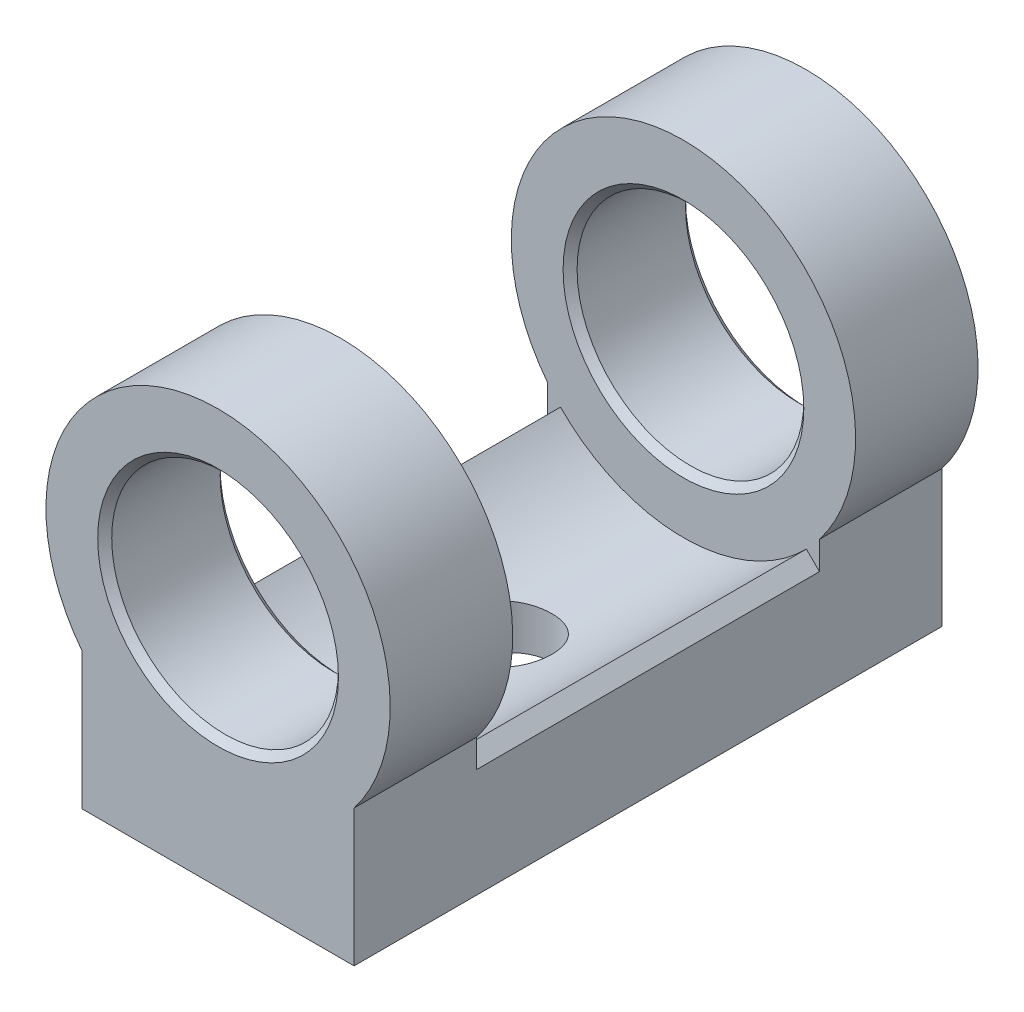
ISO-10303-21;
HEADER;
FILE_DESCRIPTION(('STEP AP214'),'2;1');
FILE_NAME('part.step','',(''),(''),'','','');
FILE_SCHEMA(('AUTOMOTIVE_DESIGN { 1 0 10303 214 1 1 1 1 }'));
ENDSEC;
DATA;
#1=APPLICATION_CONTEXT('core data for automotive mechanical design processes');
#2=APPLICATION_PROTOCOL_DEFINITION('international standard','automotive_design',2000,#1);
#3=PRODUCT_CONTEXT('',#1,'mechanical');
#4=PRODUCT('Part','Part','',(#3));
#5=PRODUCT_RELATED_PRODUCT_CATEGORY('part','',(#4));
#6=PRODUCT_DEFINITION_FORMATION('','',#4);
#7=PRODUCT_DEFINITION_CONTEXT('part definition',#1,'design');
#8=PRODUCT_DEFINITION('design','',#6,#7);
#9=PRODUCT_DEFINITION_SHAPE('','',#8);
#10=(LENGTH_UNIT() NAMED_UNIT(*) SI_UNIT(.MILLI.,.METRE.));
#11=(NAMED_UNIT(*) PLANE_ANGLE_UNIT() SI_UNIT($,.RADIAN.));
#12=(NAMED_UNIT(*) SI_UNIT($,.STERADIAN.) SOLID_ANGLE_UNIT());
#13=UNCERTAINTY_MEASURE_WITH_UNIT(LENGTH_MEASURE(1.E-05),#10,'distance_accuracy_value','');
#14=(GEOMETRIC_REPRESENTATION_CONTEXT(3) GLOBAL_UNCERTAINTY_ASSIGNED_CONTEXT((#13)) GLOBAL_UNIT_ASSIGNED_CONTEXT((#10,
#11,#12)) REPRESENTATION_CONTEXT('',''));
#15=CARTESIAN_POINT('',(0.,0.,0.));
#16=DIRECTION('',(0.,0.,1.));
#17=DIRECTION('',(1.,0.,0.));
#18=AXIS2_PLACEMENT_3D('',#15,#16,#17);
#19=CARTESIAN_POINT('',(0.,6.15,0.));
#20=DIRECTION('',(0.,-1.,0.));
#21=DIRECTION('',(0.,0.,-1.));
#22=AXIS2_PLACEMENT_3D('',#19,#20,#21);
#23=CYLINDRICAL_SURFACE('',#22,1.425);
#24=CARTESIAN_POINT('',(0.,-6.15,-1.425));
#25=CARTESIAN_POINT('',(-0.0789134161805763,-6.14999857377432,-1.42499748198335));
#26=CARTESIAN_POINT('',(-0.157856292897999,-6.1484658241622,-1.41842281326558));
#27=CARTESIAN_POINT('',(-0.313491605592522,-6.14249960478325,-1.39232996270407));
#28=CARTESIAN_POINT('',(-0.390182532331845,-6.13806423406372,-1.37280329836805));
#29=CARTESIAN_POINT('',(-0.539042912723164,-6.12678554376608,-1.32145728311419));
#30=CARTESIAN_POINT('',(-0.611217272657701,-6.11994489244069,-1.28965154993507));
#31=CARTESIAN_POINT('',(-0.749204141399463,-6.10459000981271,-1.21469538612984));
#32=CARTESIAN_POINT('',(-0.815016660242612,-6.09607578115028,-1.17154497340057));
#33=CARTESIAN_POINT('',(-0.939589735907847,-6.07813292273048,-1.07430853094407));
#34=CARTESIAN_POINT('',(-0.998220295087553,-6.06869181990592,-1.02005824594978));
#35=CARTESIAN_POINT('',(-1.10563685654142,-6.05004512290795,-0.902514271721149));
#36=CARTESIAN_POINT('',(-1.15442189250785,-6.04083955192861,-0.839219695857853));
#37=CARTESIAN_POINT('',(-1.24135120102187,-6.02358218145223,-0.70440339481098));
#38=CARTESIAN_POINT('',(-1.27935427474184,-6.0155463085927,-0.632788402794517));
#39=CARTESIAN_POINT('',(-1.34273426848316,-6.00171842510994,-0.483971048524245));
#40=CARTESIAN_POINT('',(-1.36811289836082,-5.9959261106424,-0.406769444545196));
#41=CARTESIAN_POINT('',(-1.40508840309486,-5.98736870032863,-0.250388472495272));
#42=CARTESIAN_POINT('',(-1.41691690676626,-5.98455279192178,-0.171266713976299));
#43=CARTESIAN_POINT('',(-1.42717713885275,-5.98211462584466,-0.0121155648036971));
#44=CARTESIAN_POINT('',(-1.42561072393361,-5.98249192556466,0.0679136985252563));
#45=CARTESIAN_POINT('',(-1.40931134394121,-5.98635167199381,0.224865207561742));
#46=CARTESIAN_POINT('',(-1.39485017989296,-5.98977001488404,0.301817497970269));
#47=CARTESIAN_POINT('',(-1.35360360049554,-5.9992250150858,0.452173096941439));
#48=CARTESIAN_POINT('',(-1.32681741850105,-6.00526183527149,0.525576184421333));
#49=CARTESIAN_POINT('',(-1.2614388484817,-6.0193350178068,0.667499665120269));
#50=CARTESIAN_POINT('',(-1.2227443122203,-6.0273885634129,0.735971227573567));
#51=CARTESIAN_POINT('',(-1.13471908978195,-6.04457756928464,0.865548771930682));
#52=CARTESIAN_POINT('',(-1.08538678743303,-6.05371319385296,0.926653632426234));
#53=CARTESIAN_POINT('',(-0.976059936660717,-6.07231001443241,1.04132527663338));
#54=CARTESIAN_POINT('',(-0.915834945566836,-6.08177372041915,1.09467219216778));
#55=CARTESIAN_POINT('',(-0.787183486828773,-6.09975854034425,1.19054732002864));
#56=CARTESIAN_POINT('',(-0.718756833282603,-6.10827963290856,1.23307528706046));
#57=CARTESIAN_POINT('',(-0.575358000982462,-6.1234523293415,1.306170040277));
#58=CARTESIAN_POINT('',(-0.50036917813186,-6.13009898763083,1.33670526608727));
#59=CARTESIAN_POINT('',(-0.346135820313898,-6.14073754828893,1.38467844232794));
#60=CARTESIAN_POINT('',(-0.266891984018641,-6.14472988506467,1.4021185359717));
#61=CARTESIAN_POINT('',(-0.108281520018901,-6.14954715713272,1.42308022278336));
#62=CARTESIAN_POINT('',(-0.0289565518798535,-6.15044034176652,1.42690177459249));
#63=CARTESIAN_POINT('',(0.129198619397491,-6.14915117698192,1.42133479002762));
#64=CARTESIAN_POINT('',(0.208028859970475,-6.1469690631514,1.41194726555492));
#65=CARTESIAN_POINT('',(0.361943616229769,-6.13981783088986,1.38047682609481));
#66=CARTESIAN_POINT('',(0.437062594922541,-6.13488382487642,1.35855376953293));
#67=CARTESIAN_POINT('',(0.582555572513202,-6.12278229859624,1.30281407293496));
#68=CARTESIAN_POINT('',(0.652929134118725,-6.11561457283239,1.26899633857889));
#69=CARTESIAN_POINT('',(0.788155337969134,-6.09967407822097,1.18981984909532));
#70=CARTESIAN_POINT('',(0.852903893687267,-6.09087786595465,1.14428815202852));
#71=CARTESIAN_POINT('',(0.973948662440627,-6.07269931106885,1.04320121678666));
#72=CARTESIAN_POINT('',(1.03024363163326,-6.06331688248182,0.987644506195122));
#73=CARTESIAN_POINT('',(1.13398953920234,-6.04478355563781,0.866701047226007));
#74=CARTESIAN_POINT('',(1.18123159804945,-6.03564156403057,0.801133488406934));
#75=CARTESIAN_POINT('',(1.26403703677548,-6.01884562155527,0.662820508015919));
#76=CARTESIAN_POINT('',(1.29960093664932,-6.01119160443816,0.590075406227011));
#77=CARTESIAN_POINT('',(1.35778766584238,-5.99831653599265,0.43986928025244));
#78=CARTESIAN_POINT('',(1.38048585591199,-5.99308135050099,0.36243872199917));
#79=CARTESIAN_POINT('',(1.41251016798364,-5.9856152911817,0.204723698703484));
#80=CARTESIAN_POINT('',(1.42183873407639,-5.98338386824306,0.124439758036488));
#81=CARTESIAN_POINT('',(1.42674526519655,-5.98221554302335,-0.0345896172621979));
#82=CARTESIAN_POINT('',(1.42265540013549,-5.98319905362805,-0.113324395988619));
#83=CARTESIAN_POINT('',(1.40159080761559,-5.98816817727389,-0.268949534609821));
#84=CARTESIAN_POINT('',(1.38461627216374,-5.99215374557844,-0.345839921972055));
#85=CARTESIAN_POINT('',(1.33843332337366,-6.00263683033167,-0.495290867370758));
#86=CARTESIAN_POINT('',(1.30927885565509,-6.00912326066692,-0.567868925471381));
#87=CARTESIAN_POINT('',(1.23960804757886,-6.02388033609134,-0.707150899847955));
#88=CARTESIAN_POINT('',(1.19909036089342,-6.03215119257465,-0.773854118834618));
#89=CARTESIAN_POINT('',(1.10676576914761,-6.04977863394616,-0.9011176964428));
#90=CARTESIAN_POINT('',(1.054724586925,-6.05915551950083,-0.961505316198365));
#91=CARTESIAN_POINT('',(0.941297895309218,-6.07780844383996,-1.07279904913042));
#92=CARTESIAN_POINT('',(0.879910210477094,-6.08708445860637,-1.12370294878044));
#93=CARTESIAN_POINT('',(0.748425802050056,-6.10465547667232,-1.21531890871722));
#94=CARTESIAN_POINT('',(0.678212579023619,-6.11293373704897,-1.25586719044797));
#95=CARTESIAN_POINT('',(0.531786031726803,-6.12740544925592,-1.32452103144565));
#96=CARTESIAN_POINT('',(0.455577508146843,-6.13360054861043,-1.35263642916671));
#97=CARTESIAN_POINT('',(0.316143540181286,-6.14217730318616,-1.39094610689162));
#98=CARTESIAN_POINT('',(0.253639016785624,-6.14509186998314,-1.40369069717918));
#99=CARTESIAN_POINT('',(0.127429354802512,-6.14900374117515,-1.42071842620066));
#100=CARTESIAN_POINT('',(0.0637242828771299,-6.15000115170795,-1.42500203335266));
#101=CARTESIAN_POINT('',(0.,-6.15,-1.425));
#102=B_SPLINE_CURVE_WITH_KNOTS('',3,(#24,#25,#26,#27,#28,#29,#30,#31,#32,#33,#34,#35,#36,#37,
#38,#39,#40,#41,#42,#43,#44,#45,#46,#47,#48,#49,#50,#51,#52,#53,#54,#55,#56,#57,#58,#59,#60,#61,
#62,#63,#64,#65,#66,#67,#68,#69,#70,#71,#72,#73,#74,#75,#76,#77,#78,#79,#80,#81,#82,#83,#84,#85,
#86,#87,#88,#89,#90,#91,#92,#93,#94,#95,#96,#97,#98,#99,#100,#101),.UNSPECIFIED.,.T.,.F.,(4,2,2,
2,2,2,2,2,2,2,2,2,2,2,2,2,2,2,2,2,2,2,2,2,2,2,2,2,2,2,2,2,2,2,2,2,2,2,4),(0.,0.236506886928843,
0.473168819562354,0.709569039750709,0.945968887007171,1.18615934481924,1.42637336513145,
1.66960153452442,1.91279675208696,2.15176961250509,2.39070934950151,2.6247286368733,
2.85876248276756,3.09486259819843,3.33099860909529,3.5728864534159,3.81477978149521,
4.05730548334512,4.2997914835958,4.5369023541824,4.7739950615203,5.00812962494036,
5.2422857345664,5.48011996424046,5.71798915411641,5.9608181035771,6.20363623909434,
6.44501696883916,6.68635356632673,6.92176144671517,7.15716581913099,7.39153844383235,
7.62593884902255,7.86563263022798,8.10538228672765,8.34871688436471,8.59185857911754,
8.78285355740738,8.97383796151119),.UNSPECIFIED.);
#103=CARTESIAN_POINT('',(0.,-6.15,-1.425));
#104=VERTEX_POINT('',#103);
#105=EDGE_CURVE('E135',#104,#104,#102,.T.);
#106=ORIENTED_EDGE('',*,*,#105,.T.);
#107=EDGE_LOOP('',(#106));
#108=FACE_BOUND('',#107,.T.);
#109=CARTESIAN_POINT('',(0.,-7.65685424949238,0.));
#110=DIRECTION('',(0.,-1.,0.));
#111=DIRECTION('',(0.,0.,-1.));
#112=AXIS2_PLACEMENT_3D('',#109,#110,#111);
#113=CIRCLE('',#112,1.425);
#114=CARTESIAN_POINT('',(0.,-7.65685424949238,-1.425));
#115=VERTEX_POINT('',#114);
#116=EDGE_CURVE('E161',#115,#115,#113,.F.);
#117=ORIENTED_EDGE('',*,*,#116,.F.);
#118=EDGE_LOOP('',(#117));
#119=FACE_BOUND('',#118,.T.);
#120=ADVANCED_FACE('F41',(#108,#119),#23,.F.);
#121=CARTESIAN_POINT('',(0.,0.,10.5));
#122=DIRECTION('',(0.,0.,-1.));
#123=DIRECTION('',(-1.,0.,0.));
#124=AXIS2_PLACEMENT_3D('',#121,#122,#123);
#125=CYLINDRICAL_SURFACE('',#124,6.15);
#126=CARTESIAN_POINT('',(0.,0.,-6.125));
#127=DIRECTION('',(0.,0.,1.));
#128=DIRECTION('',(1.,0.,0.));
#129=AXIS2_PLACEMENT_3D('',#126,#127,#128);
#130=CIRCLE('',#129,6.15);
#131=CARTESIAN_POINT('',(4.85772580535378,-3.77160443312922,-6.125));
#132=VERTEX_POINT('',#131);
#133=CARTESIAN_POINT('',(-4.85772580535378,-3.77160443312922,-6.125));
#134=VERTEX_POINT('',#133);
#135=EDGE_CURVE('E130',#132,#134,#130,.T.);
#136=ORIENTED_EDGE('',*,*,#135,.F.);
#137=DIRECTION('',(0.,0.,-1.));
#138=VECTOR('',#137,1.);
#139=CARTESIAN_POINT('',(4.85772580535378,-3.77160443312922,10.5));
#140=LINE('',#139,#138);
#141=CARTESIAN_POINT('',(4.85772580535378,-3.77160443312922,-10.5));
#142=VERTEX_POINT('',#141);
#143=EDGE_CURVE('E220',#132,#142,#140,.T.);
#144=ORIENTED_EDGE('',*,*,#143,.T.);
#145=CARTESIAN_POINT('',(0.,0.,-10.5));
#146=DIRECTION('',(0.,0.,1.));
#147=DIRECTION('',(1.,0.,0.));
#148=AXIS2_PLACEMENT_3D('',#145,#146,#147);
#149=CIRCLE('',#148,6.15);
#150=CARTESIAN_POINT('',(-4.85772580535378,-3.77160443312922,-10.5));
#151=VERTEX_POINT('',#150);
#152=EDGE_CURVE('E140',#142,#151,#149,.T.);
#153=ORIENTED_EDGE('',*,*,#152,.T.);
#154=DIRECTION('',(0.,0.,-1.));
#155=VECTOR('',#154,1.);
#156=CARTESIAN_POINT('',(-4.85772580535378,-3.77160443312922,10.5));
#157=LINE('',#156,#155);
#158=EDGE_CURVE('E122',#134,#151,#157,.T.);
#159=ORIENTED_EDGE('',*,*,#158,.F.);
#160=EDGE_LOOP('',(#136,#144,#153,#159));
#161=FACE_BOUND('',#160,.T.);
#162=ADVANCED_FACE('F138',(#161),#125,.T.);
#163=CARTESIAN_POINT('',(0.,0.,10.5));
#164=DIRECTION('',(0.,0.,-1.));
#165=DIRECTION('',(-1.,0.,0.));
#166=AXIS2_PLACEMENT_3D('',#163,#164,#165);
#167=CYLINDRICAL_SURFACE('',#166,4.05);
#168=CARTESIAN_POINT('',(0.,0.,-10.25));
#169=DIRECTION('',(0.,0.,1.));
#170=DIRECTION('',(1.,0.,0.));
#171=AXIS2_PLACEMENT_3D('',#168,#169,#170);
#172=CIRCLE('',#171,4.05);
#173=CARTESIAN_POINT('',(-4.05,0.,-10.25));
#174=VERTEX_POINT('',#173);
#175=EDGE_CURVE('E296',#174,#174,#172,.F.);
#176=CARTESIAN_POINT('',(0.,0.,-6.37500000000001));
#177=DIRECTION('',(0.,0.,1.));
#178=DIRECTION('',(1.,0.,0.));
#179=AXIS2_PLACEMENT_3D('',#176,#177,#178);
#180=CIRCLE('',#179,4.05);
#181=CARTESIAN_POINT('',(-4.05,0.,-6.37500000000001));
#182=VERTEX_POINT('',#181);
#183=EDGE_CURVE('E300',#182,#182,#180,.T.);
#184=CARTESIAN_POINT('',(-4.05,0.,-10.25));
#185=CARTESIAN_POINT('',(-4.05,0.,-10.2096354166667));
#186=CARTESIAN_POINT('',(-4.05,0.,-10.1692708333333));
#187=CARTESIAN_POINT('',(-4.05,0.,-10.0885416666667));
#188=CARTESIAN_POINT('',(-4.05,0.,-10.0481770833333));
#189=CARTESIAN_POINT('',(-4.05,0.,-9.96744791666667));
#190=CARTESIAN_POINT('',(-4.05,0.,-9.92708333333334));
#191=CARTESIAN_POINT('',(-4.05,0.,-9.84635416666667));
#192=CARTESIAN_POINT('',(-4.05,0.,-9.80598958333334));
#193=CARTESIAN_POINT('',(-4.05,0.,-9.72526041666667));
#194=CARTESIAN_POINT('',(-4.05,0.,-9.68489583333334));
#195=CARTESIAN_POINT('',(-4.05,0.,-9.60416666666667));
#196=CARTESIAN_POINT('',(-4.05,0.,-9.56380208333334));
#197=CARTESIAN_POINT('',(-4.05,0.,-9.48307291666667));
#198=CARTESIAN_POINT('',(-4.05,0.,-9.44270833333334));
#199=CARTESIAN_POINT('',(-4.05,0.,-9.36197916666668));
#200=CARTESIAN_POINT('',(-4.05,0.,-9.32161458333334));
#201=CARTESIAN_POINT('',(-4.05,0.,-9.24088541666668));
#202=CARTESIAN_POINT('',(-4.05,0.,-9.20052083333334));
#203=CARTESIAN_POINT('',(-4.05,0.,-9.11979166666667));
#204=CARTESIAN_POINT('',(-4.05,0.,-9.07942708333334));
#205=CARTESIAN_POINT('',(-4.05,0.,-8.99869791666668));
#206=CARTESIAN_POINT('',(-4.05,0.,-8.95833333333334));
#207=CARTESIAN_POINT('',(-4.05,0.,-8.87760416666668));
#208=CARTESIAN_POINT('',(-4.05,0.,-8.83723958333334));
#209=CARTESIAN_POINT('',(-4.05,0.,-8.75651041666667));
#210=CARTESIAN_POINT('',(-4.05,0.,-8.71614583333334));
#211=CARTESIAN_POINT('',(-4.05,0.,-8.63541666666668));
#212=CARTESIAN_POINT('',(-4.05,0.,-8.59505208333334));
#213=CARTESIAN_POINT('',(-4.05,0.,-8.51432291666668));
#214=CARTESIAN_POINT('',(-4.05,0.,-8.47395833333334));
#215=CARTESIAN_POINT('',(-4.05,0.,-8.39322916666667));
#216=CARTESIAN_POINT('',(-4.05,0.,-8.35286458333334));
#217=CARTESIAN_POINT('',(-4.05,0.,-8.27213541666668));
#218=CARTESIAN_POINT('',(-4.05,0.,-8.23177083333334));
#219=CARTESIAN_POINT('',(-4.05,0.,-8.15104166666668));
#220=CARTESIAN_POINT('',(-4.05,0.,-8.11067708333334));
#221=CARTESIAN_POINT('',(-4.05,0.,-8.02994791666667));
#222=CARTESIAN_POINT('',(-4.05,0.,-7.98958333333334));
#223=CARTESIAN_POINT('',(-4.05,0.,-7.90885416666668));
#224=CARTESIAN_POINT('',(-4.05,0.,-7.86848958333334));
#225=CARTESIAN_POINT('',(-4.05,0.,-7.78776041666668));
#226=CARTESIAN_POINT('',(-4.05,0.,-7.74739583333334));
#227=CARTESIAN_POINT('',(-4.05,0.,-7.66666666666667));
#228=CARTESIAN_POINT('',(-4.05,0.,-7.62630208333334));
#229=CARTESIAN_POINT('',(-4.05,0.,-7.54557291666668));
#230=CARTESIAN_POINT('',(-4.05,0.,-7.50520833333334));
#231=CARTESIAN_POINT('',(-4.05,0.,-7.42447916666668));
#232=CARTESIAN_POINT('',(-4.05,0.,-7.38411458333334));
#233=CARTESIAN_POINT('',(-4.05,0.,-7.30338541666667));
#234=CARTESIAN_POINT('',(-4.05,0.,-7.26302083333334));
#235=CARTESIAN_POINT('',(-4.05,0.,-7.18229166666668));
#236=CARTESIAN_POINT('',(-4.05,0.,-7.14192708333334));
#237=CARTESIAN_POINT('',(-4.05,0.,-7.06119791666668));
#238=CARTESIAN_POINT('',(-4.05,0.,-7.02083333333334));
#239=CARTESIAN_POINT('',(-4.05,0.,-6.94010416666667));
#240=CARTESIAN_POINT('',(-4.05,0.,-6.89973958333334));
#241=CARTESIAN_POINT('',(-4.05,0.,-6.81901041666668));
#242=CARTESIAN_POINT('',(-4.05,0.,-6.77864583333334));
#243=CARTESIAN_POINT('',(-4.05,0.,-6.69791666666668));
#244=CARTESIAN_POINT('',(-4.05,0.,-6.65755208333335));
#245=CARTESIAN_POINT('',(-4.05,0.,-6.57682291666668));
#246=CARTESIAN_POINT('',(-4.05,0.,-6.53645833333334));
#247=CARTESIAN_POINT('',(-4.05,0.,-6.45572916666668));
#248=CARTESIAN_POINT('',(-4.05,0.,-6.41536458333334));
#249=CARTESIAN_POINT('',(-4.05,0.,-6.37500000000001));
#250=B_SPLINE_CURVE_WITH_KNOTS('',3,(#184,#185,#186,#187,#188,#189,#190,#191,#192,#193,#194,
#195,#196,#197,#198,#199,#200,#201,#202,#203,#204,#205,#206,#207,#208,#209,#210,#211,#212,#213,
#214,#215,#216,#217,#218,#219,#220,#221,#222,#223,#224,#225,#226,#227,#228,#229,#230,#231,#232,
#233,#234,#235,#236,#237,#238,#239,#240,#241,#242,#243,#244,#245,#246,#247,#248,#249),
.UNSPECIFIED.,.F.,.F.,(4,2,2,2,2,2,2,2,2,2,2,2,2,2,2,2,2,2,2,2,2,2,2,2,2,2,2,2,2,2,2,2,4),(0.,
0.121093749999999,0.242187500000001,0.36328125,0.484374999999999,0.605468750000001,0.7265625,
0.847656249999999,0.968749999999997,1.08984375,1.2109375,1.33203125,1.453125,1.57421875,
1.6953125,1.81640625,1.9375,2.05859375,2.1796875,2.30078125,2.421875,2.54296875,2.6640625,
2.78515625,2.90625,3.02734375,3.1484375,3.26953125,3.390625,3.51171875,3.6328125,3.75390625,
3.875),.UNSPECIFIED.);
#251=EDGE_CURVE('BSEAM437',#174,#182,#250,.T.);
#252=ORIENTED_EDGE('',*,*,#175,.T.);
#253=ORIENTED_EDGE('',*,*,#183,.T.);
#254=ORIENTED_EDGE('',*,*,#251,.T.);
#255=ORIENTED_EDGE('',*,*,#251,.F.);
#256=EDGE_LOOP('',(#252,#254,#253,#255));
#257=FACE_BOUND('',#256,.T.);
#258=ADVANCED_FACE('F437',(#257),#167,.F.);
#259=CARTESIAN_POINT('',(4.85772580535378,-3.77160443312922,10.5));
#260=VERTEX_POINT('',#259);
#261=CARTESIAN_POINT('',(4.85772580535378,-3.77160443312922,6.125));
#262=VERTEX_POINT('',#261);
#263=EDGE_CURVE('E230',#260,#262,#140,.T.);
#264=ORIENTED_EDGE('',*,*,#263,.T.);
#265=CARTESIAN_POINT('',(0.,0.,6.125));
#266=DIRECTION('',(0.,0.,1.));
#267=DIRECTION('',(1.,0.,0.));
#268=AXIS2_PLACEMENT_3D('',#265,#266,#267);
#269=CIRCLE('',#268,6.15);
#270=CARTESIAN_POINT('',(-4.85772580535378,-3.77160443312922,6.125));
#271=VERTEX_POINT('',#270);
#272=EDGE_CURVE('E198',#262,#271,#269,.T.);
#273=ORIENTED_EDGE('',*,*,#272,.T.);
#274=CARTESIAN_POINT('',(-4.85772580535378,-3.77160443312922,10.5));
#275=VERTEX_POINT('',#274);
#276=EDGE_CURVE('E142',#275,#271,#157,.T.);
#277=ORIENTED_EDGE('',*,*,#276,.F.);
#278=CARTESIAN_POINT('',(0.,0.,10.5));
#279=DIRECTION('',(0.,0.,1.));
#280=DIRECTION('',(1.,0.,0.));
#281=AXIS2_PLACEMENT_3D('',#278,#279,#280);
#282=CIRCLE('',#281,6.15);
#283=EDGE_CURVE('E207',#260,#275,#282,.T.);
#284=ORIENTED_EDGE('',*,*,#283,.F.);
#285=EDGE_LOOP('',(#264,#273,#277,#284));
#286=FACE_BOUND('',#285,.T.);
#287=ADVANCED_FACE('F252',(#286),#125,.T.);
#288=CARTESIAN_POINT('',(-4.85772580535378,0.,10.5));
#289=DIRECTION('',(1.,0.,0.));
#290=DIRECTION('',(0.,1.,0.));
#291=AXIS2_PLACEMENT_3D('',#288,#289,#290);
#292=PLANE('',#291);
#293=ORIENTED_EDGE('',*,*,#276,.T.);
#294=DIRECTION('',(0.,-1.,0.));
#295=VECTOR('',#294,1.);
#296=CARTESIAN_POINT('',(-4.85772580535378,0.,6.125));
#297=LINE('',#296,#295);
#298=CARTESIAN_POINT('',(-4.85772580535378,-4.77160443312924,6.125));
#299=VERTEX_POINT('',#298);
#300=EDGE_CURVE('E57',#271,#299,#297,.T.);
#301=ORIENTED_EDGE('',*,*,#300,.T.);
#302=DIRECTION('',(0.,0.,-1.));
#303=VECTOR('',#302,1.);
#304=CARTESIAN_POINT('',(-4.85772580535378,-4.77160443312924,-6.125));
#305=LINE('',#304,#303);
#306=CARTESIAN_POINT('',(-4.85772580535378,-4.77160443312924,-6.125));
#307=VERTEX_POINT('',#306);
#308=EDGE_CURVE('E125',#299,#307,#305,.T.);
#309=ORIENTED_EDGE('',*,*,#308,.T.);
#310=DIRECTION('',(0.,1.,0.));
#311=VECTOR('',#310,1.);
#312=CARTESIAN_POINT('',(-4.85772580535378,0.,-6.125));
#313=LINE('',#312,#311);
#314=EDGE_CURVE('E119',#307,#134,#313,.T.);
#315=ORIENTED_EDGE('',*,*,#314,.T.);
#316=ORIENTED_EDGE('',*,*,#158,.T.);
#317=DIRECTION('',(0.,-1.,0.));
#318=VECTOR('',#317,1.);
#319=CARTESIAN_POINT('',(-4.85772580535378,0.,-10.5));
#320=LINE('',#319,#318);
#321=CARTESIAN_POINT('',(-4.85772580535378,-8.65685424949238,-10.5));
#322=VERTEX_POINT('',#321);
#323=EDGE_CURVE('E202',#151,#322,#320,.T.);
#324=ORIENTED_EDGE('',*,*,#323,.T.);
#325=DIRECTION('',(0.,0.,-1.));
#326=VECTOR('',#325,1.);
#327=CARTESIAN_POINT('',(-4.85772580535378,-8.65685424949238,10.5));
#328=LINE('',#327,#326);
#329=CARTESIAN_POINT('',(-4.85772580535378,-8.65685424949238,10.5));
#330=VERTEX_POINT('',#329);
#331=EDGE_CURVE('E143',#330,#322,#328,.T.);
#332=ORIENTED_EDGE('',*,*,#331,.F.);
#333=DIRECTION('',(0.,-1.,0.));
#334=VECTOR('',#333,1.);
#335=CARTESIAN_POINT('',(-4.85772580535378,0.,10.5));
#336=LINE('',#335,#334);
#337=EDGE_CURVE('E211',#275,#330,#336,.T.);
#338=ORIENTED_EDGE('',*,*,#337,.F.);
#339=EDGE_LOOP('',(#293,#301,#309,#315,#316,#324,#332,#338));
#340=FACE_BOUND('',#339,.T.);
#341=ADVANCED_FACE('F120',(#340),#292,.F.);
#342=CARTESIAN_POINT('',(0.,-8.65685424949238,10.5));
#343=DIRECTION('',(0.,1.,0.));
#344=DIRECTION('',(0.,0.,1.));
#345=AXIS2_PLACEMENT_3D('',#342,#343,#344);
#346=PLANE('',#345);
#347=CARTESIAN_POINT('',(0.,-8.65685424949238,0.));
#348=DIRECTION('',(0.,1.,0.));
#349=DIRECTION('',(0.,0.,1.));
#350=AXIS2_PLACEMENT_3D('',#347,#348,#349);
#351=CIRCLE('',#350,3.29000000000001);
#352=CARTESIAN_POINT('',(0.,-8.65685424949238,3.29000000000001));
#353=VERTEX_POINT('',#352);
#354=EDGE_CURVE('E282',#353,#353,#351,.T.);
#355=ORIENTED_EDGE('',*,*,#354,.T.);
#356=EDGE_LOOP('',(#355));
#357=FACE_BOUND('',#356,.T.);
#358=DIRECTION('',(1.,0.,0.));
#359=VECTOR('',#358,1.);
#360=CARTESIAN_POINT('',(0.,-8.65685424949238,-10.5));
#361=LINE('',#360,#359);
#362=CARTESIAN_POINT('',(4.85772580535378,-8.65685424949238,-10.5));
#363=VERTEX_POINT('',#362);
#364=EDGE_CURVE('E224',#322,#363,#361,.T.);
#365=ORIENTED_EDGE('',*,*,#364,.T.);
#366=DIRECTION('',(0.,0.,-1.));
#367=VECTOR('',#366,1.);
#368=CARTESIAN_POINT('',(4.85772580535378,-8.65685424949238,10.5));
#369=LINE('',#368,#367);
#370=CARTESIAN_POINT('',(4.85772580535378,-8.65685424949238,10.5));
#371=VERTEX_POINT('',#370);
#372=EDGE_CURVE('E149',#371,#363,#369,.T.);
#373=ORIENTED_EDGE('',*,*,#372,.F.);
#374=DIRECTION('',(1.,0.,0.));
#375=VECTOR('',#374,1.);
#376=CARTESIAN_POINT('',(0.,-8.65685424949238,10.5));
#377=LINE('',#376,#375);
#378=EDGE_CURVE('E215',#330,#371,#377,.T.);
#379=ORIENTED_EDGE('',*,*,#378,.F.);
#380=ORIENTED_EDGE('',*,*,#331,.T.);
#381=EDGE_LOOP('',(#365,#373,#379,#380));
#382=FACE_BOUND('',#381,.T.);
#383=ADVANCED_FACE('F246',(#357,#382),#346,.F.);
#384=CARTESIAN_POINT('',(0.,0.,10.25));
#385=DIRECTION('',(0.,0.,1.));
#386=DIRECTION('',(1.,0.,0.));
#387=AXIS2_PLACEMENT_3D('',#384,#385,#386);
#388=CIRCLE('',#387,4.05);
#389=CARTESIAN_POINT('',(-4.05,0.,10.25));
#390=VERTEX_POINT('',#389);
#391=EDGE_CURVE('E312',#390,#390,#388,.T.);
#392=CARTESIAN_POINT('',(0.,0.,6.37499999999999));
#393=DIRECTION('',(0.,0.,1.));
#394=DIRECTION('',(1.,0.,0.));
#395=AXIS2_PLACEMENT_3D('',#392,#393,#394);
#396=CIRCLE('',#395,4.05);
#397=CARTESIAN_POINT('',(-4.05,0.,6.37499999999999));
#398=VERTEX_POINT('',#397);
#399=EDGE_CURVE('E147',#398,#398,#396,.F.);
#400=CARTESIAN_POINT('',(-4.05,0.,10.25));
#401=CARTESIAN_POINT('',(-4.05,0.,10.2096354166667));
#402=CARTESIAN_POINT('',(-4.05,0.,10.1692708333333));
#403=CARTESIAN_POINT('',(-4.05,0.,10.0885416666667));
#404=CARTESIAN_POINT('',(-4.05,0.,10.0481770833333));
#405=CARTESIAN_POINT('',(-4.05,0.,9.96744791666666));
#406=CARTESIAN_POINT('',(-4.05,0.,9.92708333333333));
#407=CARTESIAN_POINT('',(-4.05,0.,9.84635416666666));
#408=CARTESIAN_POINT('',(-4.05,0.,9.80598958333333));
#409=CARTESIAN_POINT('',(-4.05,0.,9.72526041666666));
#410=CARTESIAN_POINT('',(-4.05,0.,9.68489583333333));
#411=CARTESIAN_POINT('',(-4.05,0.,9.60416666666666));
#412=CARTESIAN_POINT('',(-4.05,0.,9.56380208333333));
#413=CARTESIAN_POINT('',(-4.05,0.,9.48307291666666));
#414=CARTESIAN_POINT('',(-4.05,0.,9.44270833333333));
#415=CARTESIAN_POINT('',(-4.05,0.,9.36197916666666));
#416=CARTESIAN_POINT('',(-4.05,0.,9.32161458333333));
#417=CARTESIAN_POINT('',(-4.05,0.,9.24088541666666));
#418=CARTESIAN_POINT('',(-4.05,0.,9.20052083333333));
#419=CARTESIAN_POINT('',(-4.05,0.,9.11979166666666));
#420=CARTESIAN_POINT('',(-4.05,0.,9.07942708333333));
#421=CARTESIAN_POINT('',(-4.05,0.,8.99869791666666));
#422=CARTESIAN_POINT('',(-4.05,0.,8.95833333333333));
#423=CARTESIAN_POINT('',(-4.05,0.,8.87760416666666));
#424=CARTESIAN_POINT('',(-4.05,0.,8.83723958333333));
#425=CARTESIAN_POINT('',(-4.05,0.,8.75651041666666));
#426=CARTESIAN_POINT('',(-4.05,0.,8.71614583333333));
#427=CARTESIAN_POINT('',(-4.05,0.,8.63541666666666));
#428=CARTESIAN_POINT('',(-4.05,0.,8.59505208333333));
#429=CARTESIAN_POINT('',(-4.05,0.,8.51432291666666));
#430=CARTESIAN_POINT('',(-4.05,0.,8.47395833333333));
#431=CARTESIAN_POINT('',(-4.05,0.,8.39322916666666));
#432=CARTESIAN_POINT('',(-4.05,0.,8.35286458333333));
#433=CARTESIAN_POINT('',(-4.05,0.,8.27213541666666));
#434=CARTESIAN_POINT('',(-4.05,0.,8.23177083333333));
#435=CARTESIAN_POINT('',(-4.05,0.,8.15104166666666));
#436=CARTESIAN_POINT('',(-4.05,0.,8.11067708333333));
#437=CARTESIAN_POINT('',(-4.05,0.,8.02994791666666));
#438=CARTESIAN_POINT('',(-4.05,0.,7.98958333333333));
#439=CARTESIAN_POINT('',(-4.05,0.,7.90885416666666));
#440=CARTESIAN_POINT('',(-4.05,0.,7.86848958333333));
#441=CARTESIAN_POINT('',(-4.05,0.,7.78776041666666));
#442=CARTESIAN_POINT('',(-4.05,0.,7.74739583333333));
#443=CARTESIAN_POINT('',(-4.05,0.,7.66666666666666));
#444=CARTESIAN_POINT('',(-4.05,0.,7.62630208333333));
#445=CARTESIAN_POINT('',(-4.05,0.,7.54557291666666));
#446=CARTESIAN_POINT('',(-4.05,0.,7.50520833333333));
#447=CARTESIAN_POINT('',(-4.05,0.,7.42447916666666));
#448=CARTESIAN_POINT('',(-4.05,0.,7.38411458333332));
#449=CARTESIAN_POINT('',(-4.05,0.,7.30338541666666));
#450=CARTESIAN_POINT('',(-4.05,0.,7.26302083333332));
#451=CARTESIAN_POINT('',(-4.05,0.,7.18229166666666));
#452=CARTESIAN_POINT('',(-4.05,0.,7.14192708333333));
#453=CARTESIAN_POINT('',(-4.05,0.,7.06119791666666));
#454=CARTESIAN_POINT('',(-4.05,0.,7.02083333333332));
#455=CARTESIAN_POINT('',(-4.05,0.,6.94010416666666));
#456=CARTESIAN_POINT('',(-4.05,0.,6.89973958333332));
#457=CARTESIAN_POINT('',(-4.05,0.,6.81901041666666));
#458=CARTESIAN_POINT('',(-4.05,0.,6.77864583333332));
#459=CARTESIAN_POINT('',(-4.05,0.,6.69791666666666));
#460=CARTESIAN_POINT('',(-4.05,0.,6.65755208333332));
#461=CARTESIAN_POINT('',(-4.05,0.,6.57682291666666));
#462=CARTESIAN_POINT('',(-4.05,0.,6.53645833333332));
#463=CARTESIAN_POINT('',(-4.05,0.,6.45572916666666));
#464=CARTESIAN_POINT('',(-4.05,0.,6.41536458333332));
#465=CARTESIAN_POINT('',(-4.05,0.,6.37499999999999));
#466=B_SPLINE_CURVE_WITH_KNOTS('',3,(#400,#401,#402,#403,#404,#405,#406,#407,#408,#409,#410,
#411,#412,#413,#414,#415,#416,#417,#418,#419,#420,#421,#422,#423,#424,#425,#426,#427,#428,#429,
#430,#431,#432,#433,#434,#435,#436,#437,#438,#439,#440,#441,#442,#443,#444,#445,#446,#447,#448,
#449,#450,#451,#452,#453,#454,#455,#456,#457,#458,#459,#460,#461,#462,#463,#464,#465),
.UNSPECIFIED.,.F.,.F.,(4,2,2,2,2,2,2,2,2,2,2,2,2,2,2,2,2,2,2,2,2,2,2,2,2,2,2,2,2,2,2,2,4),(0.,
0.121093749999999,0.242187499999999,0.36328125,0.484375,0.605468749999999,0.7265625,0.84765625,
0.968750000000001,1.08984375,1.2109375,1.33203125,1.453125,1.57421875,1.6953125,1.81640625,
1.9375,2.05859375,2.1796875,2.30078125,2.421875,2.54296875,2.6640625,2.78515625,2.90625,
3.02734375,3.1484375,3.26953125,3.390625,3.51171875,3.6328125,3.75390625,3.875),.UNSPECIFIED.);
#467=EDGE_CURVE('BSEAM319',#390,#398,#466,.T.);
#468=ORIENTED_EDGE('',*,*,#391,.T.);
#469=ORIENTED_EDGE('',*,*,#399,.T.);
#470=ORIENTED_EDGE('',*,*,#467,.T.);
#471=ORIENTED_EDGE('',*,*,#467,.F.);
#472=EDGE_LOOP('',(#468,#470,#469,#471));
#473=FACE_BOUND('',#472,.T.);
#474=ADVANCED_FACE('F319',(#473),#167,.F.);
#475=CARTESIAN_POINT('',(4.85772580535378,0.,10.5));
#476=DIRECTION('',(-1.,0.,0.));
#477=DIRECTION('',(0.,-1.,0.));
#478=AXIS2_PLACEMENT_3D('',#475,#476,#477);
#479=PLANE('',#478);
#480=ORIENTED_EDGE('',*,*,#143,.F.);
#481=DIRECTION('',(0.,-1.,0.));
#482=VECTOR('',#481,1.);
#483=CARTESIAN_POINT('',(4.85772580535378,0.,-6.125));
#484=LINE('',#483,#482);
#485=CARTESIAN_POINT('',(4.85772580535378,-4.77160443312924,-6.125));
#486=VERTEX_POINT('',#485);
#487=EDGE_CURVE('E65',#132,#486,#484,.T.);
#488=ORIENTED_EDGE('',*,*,#487,.T.);
#489=DIRECTION('',(0.,0.,1.));
#490=VECTOR('',#489,1.);
#491=CARTESIAN_POINT('',(4.85772580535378,-4.77160443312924,6.125));
#492=LINE('',#491,#490);
#493=CARTESIAN_POINT('',(4.85772580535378,-4.77160443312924,6.125));
#494=VERTEX_POINT('',#493);
#495=EDGE_CURVE('E256',#486,#494,#492,.T.);
#496=ORIENTED_EDGE('',*,*,#495,.T.);
#497=DIRECTION('',(0.,1.,0.));
#498=VECTOR('',#497,1.);
#499=CARTESIAN_POINT('',(4.85772580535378,0.,6.125));
#500=LINE('',#499,#498);
#501=EDGE_CURVE('E253',#494,#262,#500,.T.);
#502=ORIENTED_EDGE('',*,*,#501,.T.);
#503=ORIENTED_EDGE('',*,*,#263,.F.);
#504=DIRECTION('',(0.,1.,0.));
#505=VECTOR('',#504,1.);
#506=CARTESIAN_POINT('',(4.85772580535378,0.,10.5));
#507=LINE('',#506,#505);
#508=EDGE_CURVE('E218',#371,#260,#507,.T.);
#509=ORIENTED_EDGE('',*,*,#508,.F.);
#510=ORIENTED_EDGE('',*,*,#372,.T.);
#511=DIRECTION('',(0.,1.,0.));
#512=VECTOR('',#511,1.);
#513=CARTESIAN_POINT('',(4.85772580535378,0.,-10.5));
#514=LINE('',#513,#512);
#515=EDGE_CURVE('E212',#363,#142,#514,.T.);
#516=ORIENTED_EDGE('',*,*,#515,.T.);
#517=EDGE_LOOP('',(#480,#488,#496,#502,#503,#509,#510,#516));
#518=FACE_BOUND('',#517,.T.);
#519=ADVANCED_FACE('F239',(#518),#479,.F.);
#520=CARTESIAN_POINT('',(0.,0.,10.5));
#521=DIRECTION('',(0.,0.,1.));
#522=DIRECTION('',(1.,0.,0.));
#523=AXIS2_PLACEMENT_3D('',#520,#521,#522);
#524=PLANE('',#523);
#525=CARTESIAN_POINT('',(0.,0.,10.5));
#526=DIRECTION('',(0.,0.,1.));
#527=DIRECTION('',(1.,0.,0.));
#528=AXIS2_PLACEMENT_3D('',#525,#526,#527);
#529=CIRCLE('',#528,4.30000000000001);
#530=CARTESIAN_POINT('',(4.30000000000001,0.,10.5));
#531=VERTEX_POINT('',#530);
#532=EDGE_CURVE('E308',#531,#531,#529,.F.);
#533=ORIENTED_EDGE('',*,*,#532,.T.);
#534=EDGE_LOOP('',(#533));
#535=FACE_BOUND('',#534,.T.);
#536=ORIENTED_EDGE('',*,*,#283,.T.);
#537=ORIENTED_EDGE('',*,*,#337,.T.);
#538=ORIENTED_EDGE('',*,*,#378,.T.);
#539=ORIENTED_EDGE('',*,*,#508,.T.);
#540=EDGE_LOOP('',(#536,#537,#538,#539));
#541=FACE_BOUND('',#540,.T.);
#542=ADVANCED_FACE('F248',(#535,#541),#524,.T.);
#543=CARTESIAN_POINT('',(0.,0.,-10.5));
#544=DIRECTION('',(0.,0.,1.));
#545=DIRECTION('',(1.,0.,0.));
#546=AXIS2_PLACEMENT_3D('',#543,#544,#545);
#547=PLANE('',#546);
#548=CARTESIAN_POINT('',(0.,0.,-10.5));
#549=DIRECTION('',(0.,0.,1.));
#550=DIRECTION('',(1.,0.,0.));
#551=AXIS2_PLACEMENT_3D('',#548,#549,#550);
#552=CIRCLE('',#551,4.29999999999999);
#553=CARTESIAN_POINT('',(4.29999999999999,0.,-10.5));
#554=VERTEX_POINT('',#553);
#555=EDGE_CURVE('E304',#554,#554,#552,.T.);
#556=ORIENTED_EDGE('',*,*,#555,.T.);
#557=EDGE_LOOP('',(#556));
#558=FACE_BOUND('',#557,.T.);
#559=ORIENTED_EDGE('',*,*,#152,.F.);
#560=ORIENTED_EDGE('',*,*,#515,.F.);
#561=ORIENTED_EDGE('',*,*,#364,.F.);
#562=ORIENTED_EDGE('',*,*,#323,.F.);
#563=EDGE_LOOP('',(#559,#560,#561,#562));
#564=FACE_BOUND('',#563,.T.);
#565=ADVANCED_FACE('F183',(#558,#564),#547,.F.);
#566=CARTESIAN_POINT('',(0.,0.,6.125));
#567=DIRECTION('',(0.,0.,-1.));
#568=DIRECTION('',(-1.,0.,0.));
#569=AXIS2_PLACEMENT_3D('',#566,#567,#568);
#570=CYLINDRICAL_SURFACE('',#569,6.15);
#571=ORIENTED_EDGE('',*,*,#105,.F.);
#572=EDGE_LOOP('',(#571));
#573=FACE_BOUND('',#572,.T.);
#574=CARTESIAN_POINT('',(-4.39155419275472,-4.30543282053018,6.125));
#575=VERTEX_POINT('',#574);
#576=CARTESIAN_POINT('',(4.39155419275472,-4.30543282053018,6.125));
#577=VERTEX_POINT('',#576);
#578=EDGE_CURVE('E190',#575,#577,#269,.T.);
#579=ORIENTED_EDGE('',*,*,#578,.T.);
#580=DIRECTION('',(0.,0.,-1.));
#581=VECTOR('',#580,1.);
#582=CARTESIAN_POINT('',(4.39155419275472,-4.30543282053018,6.125));
#583=LINE('',#582,#581);
#584=CARTESIAN_POINT('',(4.39155419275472,-4.30543282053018,-6.125));
#585=VERTEX_POINT('',#584);
#586=EDGE_CURVE('E257',#577,#585,#583,.T.);
#587=ORIENTED_EDGE('',*,*,#586,.T.);
#588=CARTESIAN_POINT('',(-4.39155419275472,-4.30543282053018,-6.125));
#589=VERTEX_POINT('',#588);
#590=EDGE_CURVE('E134',#589,#585,#130,.T.);
#591=ORIENTED_EDGE('',*,*,#590,.F.);
#592=DIRECTION('',(0.,0.,-1.));
#593=VECTOR('',#592,1.);
#594=CARTESIAN_POINT('',(-4.39155419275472,-4.30543282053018,6.125));
#595=LINE('',#594,#593);
#596=EDGE_CURVE('E279',#589,#575,#595,.F.);
#597=ORIENTED_EDGE('',*,*,#596,.T.);
#598=EDGE_LOOP('',(#579,#587,#591,#597));
#599=FACE_BOUND('',#598,.T.);
#600=ADVANCED_FACE('F163',(#573,#599),#570,.F.);
#601=CARTESIAN_POINT('',(0.,0.,6.125));
#602=DIRECTION('',(0.,0.,1.));
#603=DIRECTION('',(1.,0.,0.));
#604=AXIS2_PLACEMENT_3D('',#601,#602,#603);
#605=PLANE('',#604);
#606=CARTESIAN_POINT('',(0.,0.,6.125));
#607=DIRECTION('',(0.,0.,1.));
#608=DIRECTION('',(1.,0.,0.));
#609=AXIS2_PLACEMENT_3D('',#606,#607,#608);
#610=CIRCLE('',#609,4.29999999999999);
#611=CARTESIAN_POINT('',(4.29999999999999,0.,6.125));
#612=VERTEX_POINT('',#611);
#613=EDGE_CURVE('E187',#612,#612,#610,.T.);
#614=ORIENTED_EDGE('',*,*,#613,.T.);
#615=EDGE_LOOP('',(#614));
#616=FACE_BOUND('',#615,.T.);
#617=ORIENTED_EDGE('',*,*,#578,.F.);
#618=DIRECTION('',(-0.707106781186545,-0.70710678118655,0.));
#619=VECTOR('',#618,1.);
#620=CARTESIAN_POINT('',(-0.0430606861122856,0.0430606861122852,6.125));
#621=LINE('',#620,#619);
#622=EDGE_CURVE('E50',#575,#299,#621,.T.);
#623=ORIENTED_EDGE('',*,*,#622,.T.);
#624=ORIENTED_EDGE('',*,*,#300,.F.);
#625=ORIENTED_EDGE('',*,*,#272,.F.);
#626=ORIENTED_EDGE('',*,*,#501,.F.);
#627=DIRECTION('',(0.707106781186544,-0.707106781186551,0.));
#628=VECTOR('',#627,1.);
#629=CARTESIAN_POINT('',(0.043060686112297,0.0430606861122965,6.125));
#630=LINE('',#629,#628);
#631=EDGE_CURVE('E192',#494,#577,#630,.F.);
#632=ORIENTED_EDGE('',*,*,#631,.T.);
#633=EDGE_LOOP('',(#617,#623,#624,#625,#626,#632));
#634=FACE_BOUND('',#633,.T.);
#635=ADVANCED_FACE('F176',(#616,#634),#605,.F.);
#636=CARTESIAN_POINT('',(0.,0.,-6.125));
#637=DIRECTION('',(0.,0.,1.));
#638=DIRECTION('',(1.,0.,0.));
#639=AXIS2_PLACEMENT_3D('',#636,#637,#638);
#640=PLANE('',#639);
#641=CARTESIAN_POINT('',(0.,0.,-6.125));
#642=DIRECTION('',(0.,0.,1.));
#643=DIRECTION('',(1.,0.,0.));
#644=AXIS2_PLACEMENT_3D('',#641,#642,#643);
#645=CIRCLE('',#644,4.3);
#646=CARTESIAN_POINT('',(4.3,0.,-6.125));
#647=VERTEX_POINT('',#646);
#648=EDGE_CURVE('E292',#647,#647,#645,.F.);
#649=ORIENTED_EDGE('',*,*,#648,.T.);
#650=EDGE_LOOP('',(#649));
#651=FACE_BOUND('',#650,.T.);
#652=ORIENTED_EDGE('',*,*,#135,.T.);
#653=ORIENTED_EDGE('',*,*,#314,.F.);
#654=DIRECTION('',(0.707106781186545,0.70710678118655,0.));
#655=VECTOR('',#654,1.);
#656=CARTESIAN_POINT('',(-4.39155419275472,-4.30543282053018,-6.125));
#657=LINE('',#656,#655);
#658=EDGE_CURVE('E11',#307,#589,#657,.T.);
#659=ORIENTED_EDGE('',*,*,#658,.T.);
#660=ORIENTED_EDGE('',*,*,#590,.T.);
#661=DIRECTION('',(-0.707106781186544,0.707106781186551,0.));
#662=VECTOR('',#661,1.);
#663=CARTESIAN_POINT('',(4.39155419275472,-4.30543282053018,-6.125));
#664=LINE('',#663,#662);
#665=EDGE_CURVE('E265',#585,#486,#664,.F.);
#666=ORIENTED_EDGE('',*,*,#665,.T.);
#667=ORIENTED_EDGE('',*,*,#487,.F.);
#668=EDGE_LOOP('',(#652,#653,#659,#660,#666,#667));
#669=FACE_BOUND('',#668,.T.);
#670=ADVANCED_FACE('F131',(#651,#669),#640,.T.);
#671=CARTESIAN_POINT('',(0.,-7.65685424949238,0.));
#672=DIRECTION('',(0.,-1.,0.));
#673=DIRECTION('',(0.,0.,-1.));
#674=AXIS2_PLACEMENT_3D('',#671,#672,#673);
#675=PLANE('',#674);
#676=CARTESIAN_POINT('',(0.,-7.65685424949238,0.));
#677=DIRECTION('',(0.,-1.,0.));
#678=DIRECTION('',(0.,0.,-1.));
#679=AXIS2_PLACEMENT_3D('',#676,#677,#678);
#680=CIRCLE('',#679,3.04);
#681=CARTESIAN_POINT('',(0.,-7.65685424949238,-3.04));
#682=VERTEX_POINT('',#681);
#683=EDGE_CURVE('E351',#682,#682,#680,.T.);
#684=ORIENTED_EDGE('',*,*,#683,.T.);
#685=EDGE_LOOP('',(#684));
#686=FACE_BOUND('',#685,.T.);
#687=ORIENTED_EDGE('',*,*,#116,.T.);
#688=EDGE_LOOP('',(#687));
#689=FACE_BOUND('',#688,.T.);
#690=ADVANCED_FACE('F175',(#686,#689),#675,.T.);
#691=CARTESIAN_POINT('',(0.,-7.65685424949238,0.));
#692=DIRECTION('',(0.,-1.,0.));
#693=DIRECTION('',(0.,0.,-1.));
#694=AXIS2_PLACEMENT_3D('',#691,#692,#693);
#695=CYLINDRICAL_SURFACE('',#694,3.04);
#696=CARTESIAN_POINT('',(0.,-8.40685424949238,0.));
#697=DIRECTION('',(0.,1.,0.));
#698=DIRECTION('',(0.,0.,1.));
#699=AXIS2_PLACEMENT_3D('',#696,#697,#698);
#700=CIRCLE('',#699,3.04);
#701=CARTESIAN_POINT('',(0.,-8.40685424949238,3.04));
#702=VERTEX_POINT('',#701);
#703=EDGE_CURVE('E286',#702,#702,#700,.F.);
#704=ORIENTED_EDGE('',*,*,#703,.T.);
#705=EDGE_LOOP('',(#704));
#706=FACE_BOUND('',#705,.T.);
#707=ORIENTED_EDGE('',*,*,#683,.F.);
#708=EDGE_LOOP('',(#707));
#709=FACE_BOUND('',#708,.T.);
#710=ADVANCED_FACE('F172',(#706,#709),#695,.F.);
#711=CARTESIAN_POINT('',(0.,0.,10.25));
#712=DIRECTION('',(0.,0.,1.));
#713=DIRECTION('',(1.,0.,0.));
#714=AXIS2_PLACEMENT_3D('',#711,#712,#713);
#715=CONICAL_SURFACE('',#714,4.05,0.785398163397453);
#716=ORIENTED_EDGE('',*,*,#532,.F.);
#717=EDGE_LOOP('',(#716));
#718=FACE_BOUND('',#717,.T.);
#719=ORIENTED_EDGE('',*,*,#391,.F.);
#720=EDGE_LOOP('',(#719));
#721=FACE_BOUND('',#720,.T.);
#722=ADVANCED_FACE('F358',(#718,#721),#715,.F.);
#723=CARTESIAN_POINT('',(0.,0.,-10.5));
#724=DIRECTION('',(0.,0.,-1.));
#725=DIRECTION('',(-1.,0.,0.));
#726=AXIS2_PLACEMENT_3D('',#723,#724,#725);
#727=CONICAL_SURFACE('',#726,4.29999999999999,0.785398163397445);
#728=ORIENTED_EDGE('',*,*,#175,.F.);
#729=EDGE_LOOP('',(#728));
#730=FACE_BOUND('',#729,.T.);
#731=ORIENTED_EDGE('',*,*,#555,.F.);
#732=EDGE_LOOP('',(#731));
#733=FACE_BOUND('',#732,.T.);
#734=ADVANCED_FACE('F333',(#730,#733),#727,.F.);
#735=CARTESIAN_POINT('',(0.,0.,-6.37500000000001));
#736=DIRECTION('',(0.,0.,1.));
#737=DIRECTION('',(1.,0.,0.));
#738=AXIS2_PLACEMENT_3D('',#735,#736,#737);
#739=CONICAL_SURFACE('',#738,4.05,0.785398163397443);
#740=ORIENTED_EDGE('',*,*,#648,.F.);
#741=EDGE_LOOP('',(#740));
#742=FACE_BOUND('',#741,.T.);
#743=ORIENTED_EDGE('',*,*,#183,.F.);
#744=EDGE_LOOP('',(#743));
#745=FACE_BOUND('',#744,.T.);
#746=ADVANCED_FACE('F325',(#742,#745),#739,.F.);
#747=CARTESIAN_POINT('',(0.,0.,6.125));
#748=DIRECTION('',(0.,0.,-1.));
#749=DIRECTION('',(-1.,0.,0.));
#750=AXIS2_PLACEMENT_3D('',#747,#748,#749);
#751=CONICAL_SURFACE('',#750,4.29999999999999,0.785398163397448);
#752=ORIENTED_EDGE('',*,*,#399,.F.);
#753=EDGE_LOOP('',(#752));
#754=FACE_BOUND('',#753,.T.);
#755=ORIENTED_EDGE('',*,*,#613,.F.);
#756=EDGE_LOOP('',(#755));
#757=FACE_BOUND('',#756,.T.);
#758=ADVANCED_FACE('F321',(#754,#757),#751,.F.);
#759=CARTESIAN_POINT('',(0.,-8.40685424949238,0.));
#760=DIRECTION('',(0.,-1.,0.));
#761=DIRECTION('',(0.,0.,-1.));
#762=AXIS2_PLACEMENT_3D('',#759,#760,#761);
#763=CONICAL_SURFACE('',#762,3.04,0.785398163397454);
#764=ORIENTED_EDGE('',*,*,#354,.F.);
#765=EDGE_LOOP('',(#764));
#766=FACE_BOUND('',#765,.T.);
#767=ORIENTED_EDGE('',*,*,#703,.F.);
#768=EDGE_LOOP('',(#767));
#769=FACE_BOUND('',#768,.T.);
#770=ADVANCED_FACE('F324',(#766,#769),#763,.F.);
#771=CARTESIAN_POINT('',(4.39155419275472,-4.30543282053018,6.125));
#772=DIRECTION('',(-0.707106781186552,-0.707106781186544,0.));
#773=DIRECTION('',(0.,0.,-1.));
#774=AXIS2_PLACEMENT_3D('',#771,#772,#773);
#775=PLANE('',#774);
#776=ORIENTED_EDGE('',*,*,#631,.F.);
#777=ORIENTED_EDGE('',*,*,#495,.F.);
#778=ORIENTED_EDGE('',*,*,#665,.F.);
#779=ORIENTED_EDGE('',*,*,#586,.F.);
#780=EDGE_LOOP('',(#776,#777,#778,#779));
#781=FACE_BOUND('',#780,.T.);
#782=ADVANCED_FACE('F263',(#781),#775,.F.);
#783=CARTESIAN_POINT('',(-4.39155419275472,-4.30543282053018,6.125));
#784=DIRECTION('',(-0.70710678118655,0.707106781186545,0.));
#785=DIRECTION('',(0.,0.,-1.));
#786=AXIS2_PLACEMENT_3D('',#783,#784,#785);
#787=PLANE('',#786);
#788=ORIENTED_EDGE('',*,*,#658,.F.);
#789=ORIENTED_EDGE('',*,*,#308,.F.);
#790=ORIENTED_EDGE('',*,*,#622,.F.);
#791=ORIENTED_EDGE('',*,*,#596,.F.);
#792=EDGE_LOOP('',(#788,#789,#790,#791));
#793=FACE_BOUND('',#792,.T.);
#794=ADVANCED_FACE('F43',(#793),#787,.T.);
#795=CLOSED_SHELL('',(#120,#162,#258,#287,#341,#383,#474,#519,#542,#565,#600,#635,#670,#690,
#710,#722,#734,#746,#758,#770,#782,#794));
#796=MANIFOLD_SOLID_BREP('B2',#795);
#797=ADVANCED_BREP_SHAPE_REPRESENTATION('',(#18,#796),#14);
#798=SHAPE_DEFINITION_REPRESENTATION(#9,#797);
ENDSEC;
END-ISO-10303-21;
